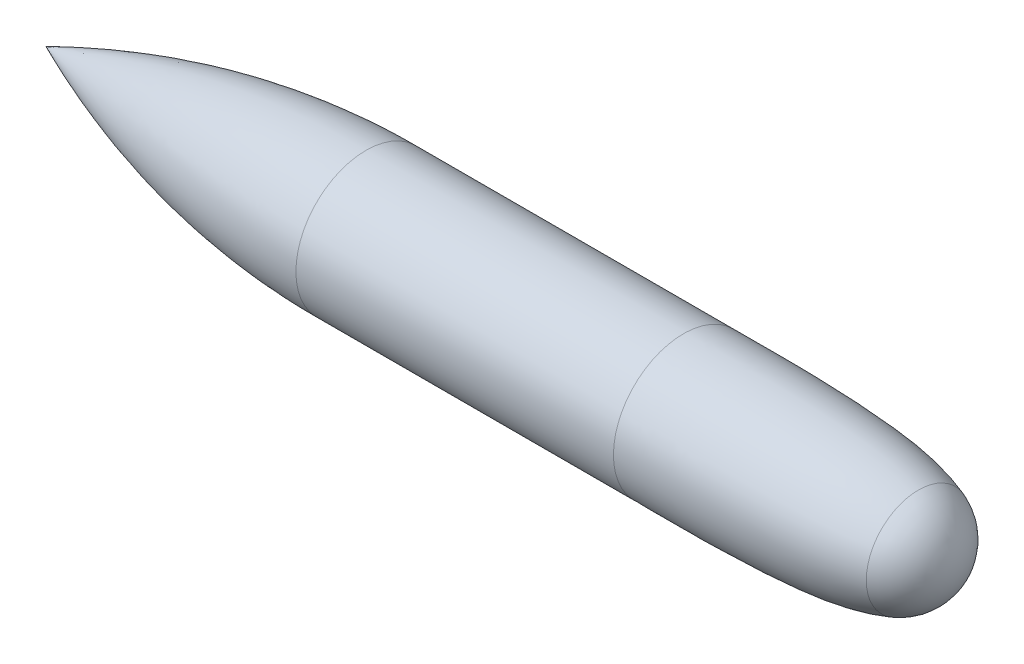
from build123d import *


with BuildPart() as part:
    # Sketch1 → Revolve1 (revolve)
    with BuildSketch(Plane.XY):
        with BuildLine():
            Line((1850.39, 405.13), (3686.81, 405.13))
            add(Edge.make_bspline(
                [(3686.81, 405.13), (3979.801823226, 405.13), (4444.956019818, 411.256271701), (4898.105789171, 353.952264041), (5045.378112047, 301.37983894)],
                knots=[0, 0, 0, 0, 0.660228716, 1, 1, 1, 1], degree=3))
            ThreePointArc((5045.378112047, 301.37983894), (5199.357966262, 184.358933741), (5257.8, 0))
            Line((5257.8, 0), (0, 0))
            add(Edge.make_bspline(
                [(0, 0), (585.273449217, 258.505072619), (1209.470507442, 405.13), (1850.39, 405.13)],
                knots=[0, 0, 0, 0, 1, 1, 1, 1], degree=3))
        make_face()
    revolve(axis=Axis((-1512.648912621, 0, 0), (1, 0, 0)))


solid = part.part
